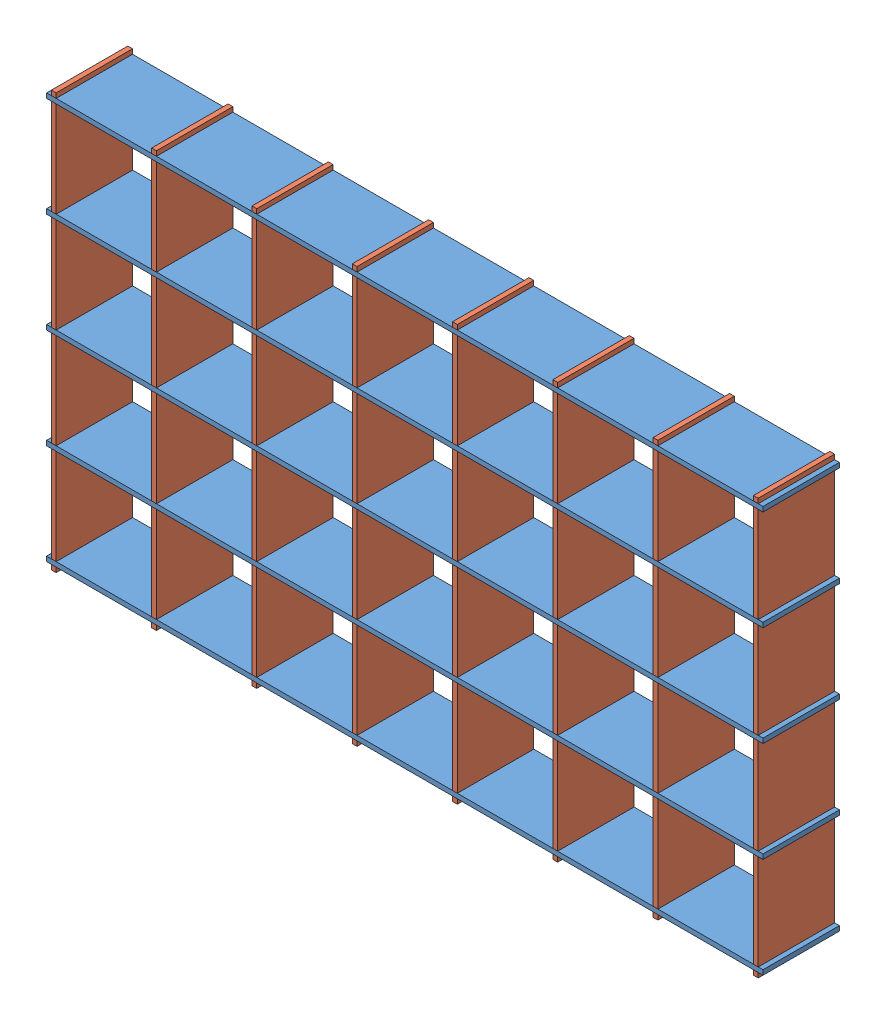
SolidWorks assembly shelves.SLDASM, configuration Default (file format 6000). Lengths in mm.
Overall size (952.5 552.45 107.95).
20 component instances, 3 part files, 40 mates.
Components (placement in the parent):
- Horizontal-6: Horizontal.SLDPRT [Default] at (-83.5049 678.0016 765.7569) size (952.5 6.35 101.6)
- Vertical-9: Vertical.SLDPRT [Default] at (-77.1549 -293.5484 664.1569) x (0 1 0) z (1 0 0) size (552.45 101.6 6.35)
- Vertical-10: Vertical.SLDPRT [Default] at (722.9451 -293.5484 664.1569) x (0 1 0) z (1 0 0) size (552.45 101.6 6.35)
- Vertical-11: Vertical.SLDPRT [Default] at (456.2451 -293.5484 664.1569) x (0 1 0) z (1 0 0) size (552.45 101.6 6.35)
- Vertical-12: Vertical.SLDPRT [Default] at (856.2951 -293.5484 664.1569) x (0 1 0) z (1 0 0) size (552.45 101.6 6.35)
- Vertical-13: Vertical.SLDPRT [Default] at (322.8951 -293.5484 664.1569) x (0 1 0) z (1 0 0) size (552.45 101.6 6.35)
- Vertical-14: Vertical.SLDPRT [Default] at (189.5451 -293.5484 664.1569) x (0 1 0) z (1 0 0) size (552.45 101.6 6.35)
- Vertical-15: Vertical.SLDPRT [Default] at (56.1951 -293.5484 664.1569) x (0 1 0) z (1 0 0) size (552.45 101.6 6.35)
- Vertical-16: Vertical.SLDPRT [Default] at (589.5951 -293.5484 664.1569) x (0 1 0) z (1 0 0) size (552.45 101.6 6.35)
- Horizontal-7: Horizontal.SLDPRT [Default] at (-83.5049 144.6016 765.7569) size (952.5 6.35 101.6)
- Horizontal-8: Horizontal.SLDPRT [Default] at (-83.5049 277.9516 765.7569) size (952.5 6.35 101.6)
- Horizontal-9: Horizontal.SLDPRT [Default] at (-83.5049 411.3016 765.7569) size (952.5 6.35 101.6)
- Horizontal-10: Horizontal.SLDPRT [Default] at (-83.5049 544.6516 765.7569) size (952.5 6.35 101.6)
- little support-1: little support.SLDPRT [Default] at (646.7451 671.6515 673.6819) size (25.4 6.35 15.88)
- little support-2: little support.SLDPRT [Default] at (780.0951 671.6516 673.6819) size (25.4 6.35 15.88)
- little support-3: little support.SLDPRT [Default] at (246.6951 671.6516 673.6819) size (25.4 6.35 15.88)
- little support-4: little support.SLDPRT [Default] at (380.0451 671.6515 673.6819) size (25.4 6.35 15.88)
- little support-5: little support.SLDPRT [Default] at (513.3951 671.6515 673.6819) size (25.4 6.35 15.88)
- little support-6: little support.SLDPRT [Default] at (113.3451 671.6516 673.6819) size (25.4 6.35 15.88)
- little support-7: little support.SLDPRT [Default] at (-20.0049 671.6516 673.6819) size (25.4 6.35 15.88)
Mates (geometry in assembly coordinates):
- Coincident52: coincident aligned: plane of Vertical-9 through (-70.8049 690.7016 765.7569) normal (0 1 0); plane of Vertical-15 through (62.5451 690.7016 765.7569) normal (0 1 0)
- Coincident53: coincident aligned: plane of Vertical-9 through (-70.8049 690.7016 765.7569) normal (0 1 0); plane of Vertical-14 through (195.8951 690.7016 765.7569) normal (0 1 0)
- Coincident54: coincident aligned: plane of Vertical-9 through (-70.8049 690.7016 765.7569) normal (0 1 0); plane of Vertical-12 through (862.6451 690.7016 765.7569) normal (0 1 0)
- Coincident55: coincident aligned: plane of Vertical-9 through (-70.8049 690.7016 765.7569) normal (0 1 0); plane of Vertical-11 through (462.5951 690.7016 765.7569) normal (0 1 0)
- Coincident56: coincident aligned: plane of Vertical-9 through (-70.8049 690.7016 765.7569) normal (0 1 0); plane of Vertical-16 through (595.9451 690.7016 765.7569) normal (0 1 0)
- Coincident57: coincident aligned: plane of Vertical-9 through (-70.8049 690.7016 765.7569) normal (0 1 0); plane of Vertical-13 through (329.2451 690.7016 765.7569) normal (0 1 0)
- Coincident58: coincident aligned: plane of Vertical-9 through (-70.8049 551.0016 765.7569) normal (0 0 1); plane of Vertical-15 through (62.5451 551.0016 765.7569) normal (0 0 1)
- Coincident59: coincident aligned: plane of Vertical-9 through (-70.8049 551.0016 765.7569) normal (0 0 1); plane of Vertical-14 through (195.8951 551.0016 765.7569) normal (0 0 1)
- Coincident60: coincident aligned: plane of Vertical-9 through (-70.8049 551.0016 765.7569) normal (0 0 1); plane of Vertical-12 through (862.6451 551.0016 765.7569) normal (0 0 1)
- Coincident61: coincident aligned: plane of Vertical-9 through (-70.8049 551.0016 765.7569) normal (0 0 1); plane of Vertical-11 through (462.5951 551.0016 765.7569) normal (0 0 1)
- Coincident62: coincident aligned: plane of Vertical-9 through (-70.8049 551.0016 765.7569) normal (0 0 1); plane of Vertical-16 through (595.9451 551.0016 765.7569) normal (0 0 1)
- Coincident63: coincident aligned: plane of Vertical-9 through (-70.8049 551.0016 765.7569) normal (0 0 1); plane of Vertical-13 through (329.2451 551.0016 765.7569) normal (0 0 1)
- Coincident64: coincident aligned: plane of Vertical-9 through (-70.8049 551.0016 765.7569) normal (0 0 1); plane of Vertical-10 through (729.2951 551.0016 765.7569) normal (0 0 1)
- Coincident65: coincident aligned: plane of Vertical-9 through (-70.8049 690.7016 765.7569) normal (0 1 0); plane of Vertical-10 through (729.2951 690.7016 765.7569) normal (0 1 0)
- Coincident66: coincident anti-aligned: plane of Horizontal-6 through (-83.5049 684.3516 765.7569) normal (0 1 0); plane of Vertical-9 through (-70.8049 684.3516 714.9569) normal (0 -1 0)
- Coincident67: coincident anti-aligned: plane of Horizontal-6 through (-77.1549 684.3516 664.1569) normal (1 0 0); plane of Vertical-9 through (-77.1549 -293.5484 664.1569) normal (-1 0 0)
- Coincident68: coincident aligned: plane of Horizontal-6 through (-70.8049 684.3516 664.1569) normal (0 0 -1); plane of Vertical-9 through (-70.8049 690.7016 664.1569) normal (0 0 -1)
- Coincident69: coincident anti-aligned: plane of Horizontal-6 through (56.1951 684.3516 664.1569) normal (1 0 0); plane of Vertical-15 through (56.1951 -293.5484 664.1569) normal (-1 0 0)
- Coincident71: coincident anti-aligned: plane of Horizontal-6 through (189.5451 684.3516 664.1569) normal (1 0 0); plane of Vertical-14 through (189.5451 -293.5484 664.1569) normal (-1 0 0)
- Coincident72: coincident anti-aligned: plane of Horizontal-6 through (456.2451 684.3516 664.1569) normal (1 0 0); plane of Vertical-11 through (456.2451 -293.5484 664.1569) normal (-1 0 0)
- Coincident73: coincident anti-aligned: plane of Horizontal-6 through (589.5951 684.3516 664.1569) normal (1 0 0); plane of Vertical-16 through (589.5951 -293.5484 664.1569) normal (-1 0 0)
- Coincident74: coincident anti-aligned: plane of Horizontal-6 through (322.8951 684.3516 664.1569) normal (1 0 0); plane of Vertical-13 through (322.8951 -293.5484 664.1569) normal (-1 0 0)
- Coincident75: coincident anti-aligned: plane of Horizontal-6 through (722.9451 684.3516 664.1569) normal (1 0 0); plane of Vertical-10 through (722.9451 -293.5484 664.1569) normal (-1 0 0)
- Coincident76: coincident anti-aligned: plane of Horizontal-6 through (856.2951 684.3516 664.1569) normal (1 0 0); plane of Vertical-12 through (856.2951 -293.5484 664.1569) normal (-1 0 0)
- Coincident77: coincident aligned: plane of Horizontal-6 through (-83.5049 684.3516 765.7569) normal (-1 0 0); plane of Horizontal-10 through (-83.5049 551.0016 765.7569) normal (-1 0 0)
- Coincident78: coincident aligned: plane of Horizontal-6 through (-83.5049 684.3516 765.7569) normal (-1 0 0); plane of Horizontal-9 through (-83.5049 417.6516 765.7569) normal (-1 0 0)
- Coincident79: coincident aligned: plane of Horizontal-6 through (-83.5049 684.3516 765.7569) normal (-1 0 0); plane of Horizontal-8 through (-83.5049 284.3016 765.7569) normal (-1 0 0)
- Coincident80: coincident aligned: plane of Horizontal-6 through (-83.5049 684.3516 765.7569) normal (-1 0 0); plane of Horizontal-7 through (-83.5049 150.9516 765.7569) normal (-1 0 0)
- Coincident81: coincident aligned: plane of Horizontal-6 through (-83.5049 684.3516 765.7569) normal (0 0 1); plane of Horizontal-10 through (-83.5049 551.0016 765.7569) normal (0 0 1)
- Coincident82: coincident aligned: plane of Horizontal-6 through (-83.5049 684.3516 765.7569) normal (0 0 1); plane of Horizontal-9 through (-83.5049 417.6516 765.7569) normal (0 0 1)
- Coincident83: coincident aligned: plane of Horizontal-6 through (-83.5049 684.3516 765.7569) normal (0 0 1); plane of Horizontal-8 through (-83.5049 284.3016 765.7569) normal (0 0 1)
- Coincident84: coincident aligned: plane of Horizontal-6 through (-83.5049 684.3516 765.7569) normal (0 0 1); plane of Horizontal-7 through (-83.5049 150.9516 765.7569) normal (0 0 1)
- Coincident85: coincident anti-aligned: plane of Vertical-9 through (-70.8049 551.0016 714.9569) normal (0 -1 0); plane of Horizontal-10 through (-83.5049 551.0016 765.7569) normal (0 1 0)
- Coincident86: coincident anti-aligned: plane of Vertical-9 through (-70.8049 417.6516 714.9569) normal (0 -1 0); plane of Horizontal-9 through (-83.5049 417.6516 765.7569) normal (0 1 0)
- Coincident87: coincident anti-aligned: plane of Vertical-9 through (-70.8049 284.3016 714.9569) normal (0 -1 0); plane of Horizontal-8 through (-83.5049 284.3016 765.7569) normal (0 1 0)
- Coincident88: coincident anti-aligned: plane of Vertical-9 through (-70.8049 150.9516 714.9569) normal (0 -1 0); plane of Horizontal-7 through (-83.5049 150.9516 765.7569) normal (0 1 0)
- Coincident94: coincident anti-aligned: plane of Horizontal-6 through (-83.5049 678.0016 765.7569) normal (0 -1 0); plane of little support-7 through (-20.0049 678.0016 673.6819) normal (0 1 0)
- Coincident95: coincident anti-aligned: plane of Horizontal-6 through (-83.5049 678.0016 765.7569) normal (0 -1 0); plane of little support-6 through (113.3451 678.0016 673.6819) normal (0 1 0)
- Coincident98: coincident anti-aligned: plane of Horizontal-6 through (-83.5049 678.0016 765.7569) normal (0 -1 0); plane of little support-3 through (246.6951 678.0016 673.6819) normal (0 1 0)
- Coincident99: coincident anti-aligned: plane of Horizontal-6 through (-83.5049 678.0016 765.7569) normal (0 -1 0); plane of little support-2 through (780.0951 678.0016 673.6819) normal (0 1 0)
